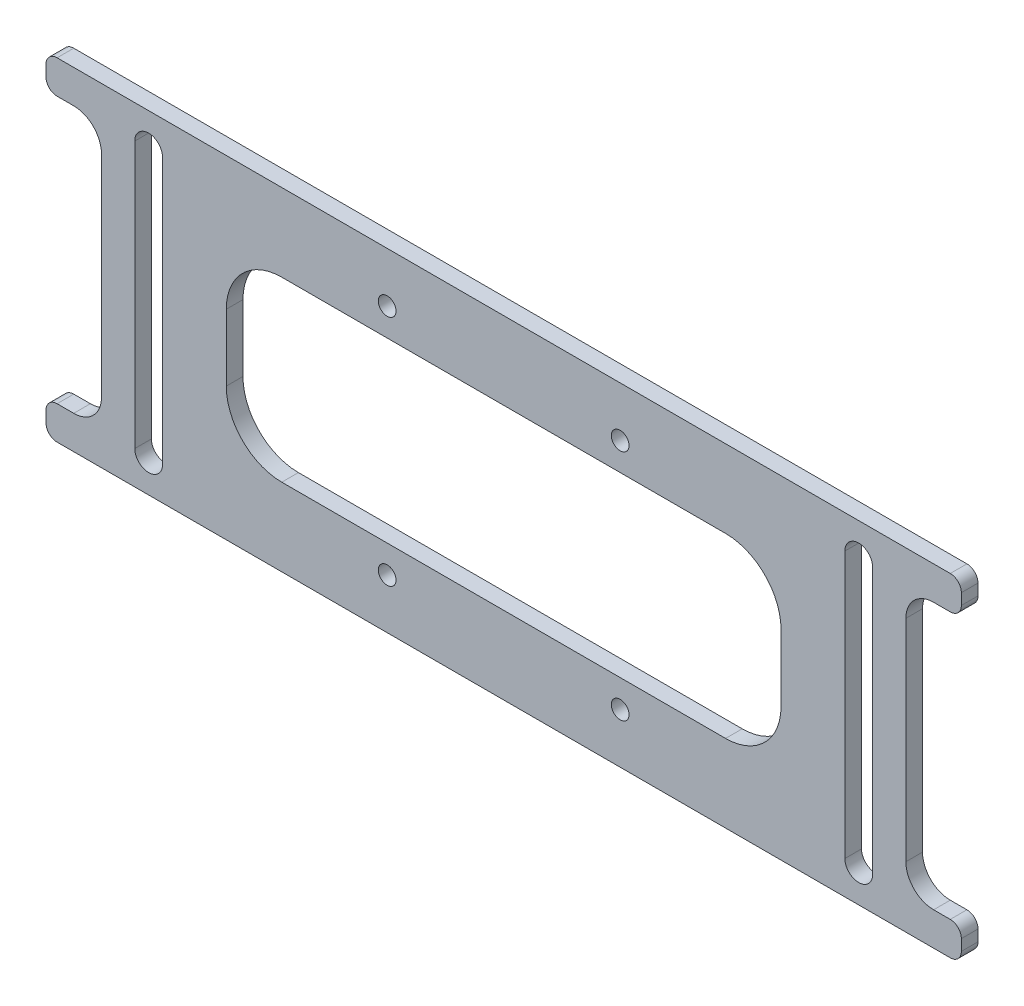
from build123d import *

# Parameters (mm, degrees)
SKETCH_1_W              = 165
SKETCH_1_H              = 60
EXTRUDE_1_DEPTH         = 3
HOLE_WIZARD_3_2_3_2_1_D = 3.2
SKETCH_4_W              = 10
SKETCH_4_H              = 48
CUT_EXTRUDE_2_DEPTH     = 3
SKETCH_5_W              = 100
SKETCH_5_H              = 32
CUT_EXTRUDE_3_DEPTH     = 3
FILLET_2_R              = 10
FILLET_3_R              = 2
FILLET_4_R              = 5


with BuildPart() as part:
    # Sketch 1 → Extrude 1 (new body)
    with BuildSketch(Plane.XY):
        Rectangle(SKETCH_1_W, SKETCH_1_H)
    extrude(amount=EXTRUDE_1_DEPTH)

    # Hole Wizard 3.2 _3.2_ _1 (through all)
    with Locations(Plane.XY.offset(3)):
        with Locations((-21, 21), (-21, -21), (21, 21), (21, -21)):
            Hole(HOLE_WIZARD_3_2_3_2_1_D / 2)

    # Sketch 4 → Cut-Extrude 2 (cut)
    with BuildSketch(Plane.XY.offset(3)):
        with Locations((-77.5, 0)):
            Rectangle(SKETCH_4_W, SKETCH_4_H)
        with Locations((77.5, 0)):
            Rectangle(SKETCH_4_W, SKETCH_4_H)
        with BuildLine():
            Line((-61.5, 24), (-61.5, -24))
            ThreePointArc((-61.5, -24), (-64, -26.5), (-66.5, -24))
            Line((-66.5, -24), (-66.5, 24))
            ThreePointArc((-66.5, 24), (-64, 26.5), (-61.5, 24))
        make_face()
        with BuildLine():
            Line((66.5, 24), (66.5, -24))
            ThreePointArc((66.5, -24), (64, -26.5), (61.5, -24))
            Line((61.5, -24), (61.5, 24))
            ThreePointArc((61.5, 24), (64, 26.5), (66.5, 24))
        make_face()
    extrude(amount=-CUT_EXTRUDE_2_DEPTH, mode=Mode.SUBTRACT)

    # Sketch 5 → Cut-Extrude 3 (cut)
    with BuildSketch(Plane.XY.offset(3)):
        Rectangle(SKETCH_5_W, SKETCH_5_H)
    extrude(amount=-CUT_EXTRUDE_3_DEPTH, mode=Mode.SUBTRACT)

    # Fillet 2
    fillet_2_edges = [part.edges().sort_by_distance(p)[0] for p in [
        (50, 16, 1.5),
        (50, -16, 1.5),
        (-50, -16, 1.5),
        (-50, 16, 1.5),
    ]]
    fillet(fillet_2_edges, radius=FILLET_2_R)

    # Fillet 3
    fillet_3_edges = [part.edges().sort_by_distance(p)[0] for p in [
        (-82.5, -24, 1.5),
        (-82.5, 24, 1.5),
        (82.5, 24, 1.5),
        (82.5, -24, 1.5),
        (82.5, -30, 1.5),
        (-82.5, -30, 1.5),
        (-82.5, 30, 1.5),
        (82.5, 30, 1.5),
    ]]
    fillet(fillet_3_edges, radius=FILLET_3_R)

    # Fillet 4
    fillet_4_edges = [part.edges().sort_by_distance(p)[0] for p in [
        (-72.5, -24, 1.5),
        (-72.5, 24, 1.5),
        (72.5, -24, 1.5),
        (72.5, 24, 1.5),
    ]]
    fillet(fillet_4_edges, radius=FILLET_4_R)


solid = part.part
